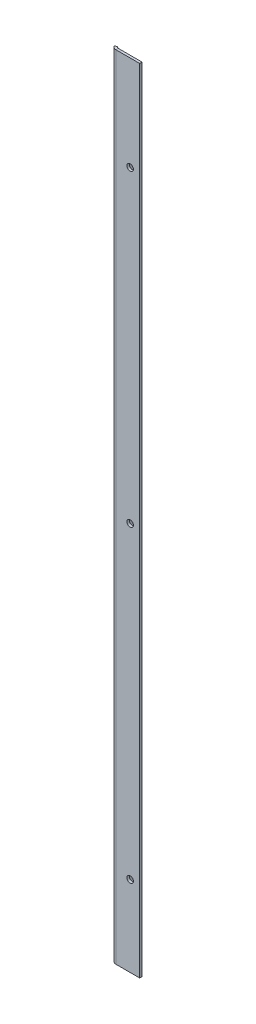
ISO-10303-21;
HEADER;
FILE_DESCRIPTION(('STEP AP214'),'2;1');
FILE_NAME('part.step','',(''),(''),'','','');
FILE_SCHEMA(('AUTOMOTIVE_DESIGN { 1 0 10303 214 1 1 1 1 }'));
ENDSEC;
DATA;
#1=APPLICATION_CONTEXT('core data for automotive mechanical design processes');
#2=APPLICATION_PROTOCOL_DEFINITION('international standard','automotive_design',2000,#1);
#3=PRODUCT_CONTEXT('',#1,'mechanical');
#4=PRODUCT('Part','Part','',(#3));
#5=PRODUCT_RELATED_PRODUCT_CATEGORY('part','',(#4));
#6=PRODUCT_DEFINITION_FORMATION('','',#4);
#7=PRODUCT_DEFINITION_CONTEXT('part definition',#1,'design');
#8=PRODUCT_DEFINITION('design','',#6,#7);
#9=PRODUCT_DEFINITION_SHAPE('','',#8);
#10=(LENGTH_UNIT() NAMED_UNIT(*) SI_UNIT(.MILLI.,.METRE.));
#11=(NAMED_UNIT(*) PLANE_ANGLE_UNIT() SI_UNIT($,.RADIAN.));
#12=(NAMED_UNIT(*) SI_UNIT($,.STERADIAN.) SOLID_ANGLE_UNIT());
#13=UNCERTAINTY_MEASURE_WITH_UNIT(LENGTH_MEASURE(1.E-05),#10,'distance_accuracy_value','');
#14=(GEOMETRIC_REPRESENTATION_CONTEXT(3) GLOBAL_UNCERTAINTY_ASSIGNED_CONTEXT((#13)) GLOBAL_UNIT_ASSIGNED_CONTEXT((#10,
#11,#12)) REPRESENTATION_CONTEXT('',''));
#15=CARTESIAN_POINT('',(0.,0.,0.));
#16=DIRECTION('',(0.,0.,1.));
#17=DIRECTION('',(1.,0.,0.));
#18=AXIS2_PLACEMENT_3D('',#15,#16,#17);
#19=CARTESIAN_POINT('',(0.,835.,25.));
#20=DIRECTION('',(0.,1.,0.));
#21=DIRECTION('',(0.,0.,1.));
#22=AXIS2_PLACEMENT_3D('',#19,#20,#21);
#23=PLANE('',#22);
#24=CARTESIAN_POINT('',(5.,835.,25.));
#25=DIRECTION('',(0.,1.,0.));
#26=DIRECTION('',(1.,0.,0.));
#27=AXIS2_PLACEMENT_3D('',#24,#25,#26);
#28=CIRCLE('',#27,2.5);
#29=CARTESIAN_POINT('',(2.8349364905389,835.,26.25));
#30=VERTEX_POINT('',#29);
#31=CARTESIAN_POINT('',(5.,835.,27.5));
#32=VERTEX_POINT('',#31);
#33=EDGE_CURVE('E128',#30,#32,#28,.T.);
#34=ORIENTED_EDGE('',*,*,#33,.F.);
#35=DIRECTION('',(-0.866025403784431,0.,0.500000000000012));
#36=VECTOR('',#35,1.);
#37=CARTESIAN_POINT('',(0.66987298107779,835.,27.5000000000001));
#38=LINE('',#37,#36);
#39=CARTESIAN_POINT('',(0.66987298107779,835.,27.5000000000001));
#40=VERTEX_POINT('',#39);
#41=EDGE_CURVE('E118',#40,#30,#38,.F.);
#42=ORIENTED_EDGE('',*,*,#41,.F.);
#43=CARTESIAN_POINT('',(5.,835.,25.));
#44=DIRECTION('',(0.,-1.,0.));
#45=DIRECTION('',(0.,0.,-1.));
#46=AXIS2_PLACEMENT_3D('',#43,#44,#45);
#47=CIRCLE('',#46,5.);
#48=CARTESIAN_POINT('',(5.,835.,30.));
#49=VERTEX_POINT('',#48);
#50=EDGE_CURVE('E67',#40,#49,#47,.F.);
#51=ORIENTED_EDGE('',*,*,#50,.T.);
#52=DIRECTION('',(0.,0.,1.));
#53=VECTOR('',#52,1.);
#54=CARTESIAN_POINT('',(5.,835.,27.5));
#55=LINE('',#54,#53);
#56=EDGE_CURVE('E11',#32,#49,#55,.T.);
#57=ORIENTED_EDGE('',*,*,#56,.F.);
#58=EDGE_LOOP('',(#34,#42,#51,#57));
#59=FACE_BOUND('',#58,.T.);
#60=ADVANCED_FACE('F42',(#59),#23,.T.);
#61=CARTESIAN_POINT('',(5.,835.,25.));
#62=DIRECTION('',(0.,-1.,0.));
#63=DIRECTION('',(0.,0.,-1.));
#64=AXIS2_PLACEMENT_3D('',#61,#62,#63);
#65=CYLINDRICAL_SURFACE('',#64,2.5);
#66=DIRECTION('',(0.,-1.,0.));
#67=VECTOR('',#66,1.);
#68=CARTESIAN_POINT('',(2.50000000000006,835.,25.));
#69=LINE('',#68,#67);
#70=CARTESIAN_POINT('',(2.50000000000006,832.5,25.));
#71=VERTEX_POINT('',#70);
#72=CARTESIAN_POINT('',(2.50000000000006,0.,25.));
#73=VERTEX_POINT('',#72);
#74=EDGE_CURVE('E157',#71,#73,#69,.T.);
#75=ORIENTED_EDGE('',*,*,#74,.F.);
#76=CARTESIAN_POINT('',(5.,832.5,25.));
#77=DIRECTION('',(0.,-0.447213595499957,0.894427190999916));
#78=DIRECTION('',(0.,-0.894427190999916,-0.447213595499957));
#79=AXIS2_PLACEMENT_3D('',#76,#77,#78);
#80=ELLIPSE('',#79,5.59016994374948,2.5);
#81=EDGE_CURVE('E124',#30,#71,#80,.T.);
#82=ORIENTED_EDGE('',*,*,#81,.F.);
#83=ORIENTED_EDGE('',*,*,#33,.T.);
#84=DIRECTION('',(0.,-1.,0.));
#85=VECTOR('',#84,1.);
#86=CARTESIAN_POINT('',(5.,835.,27.5));
#87=LINE('',#86,#85);
#88=CARTESIAN_POINT('',(5.,0.,27.5));
#89=VERTEX_POINT('',#88);
#90=EDGE_CURVE('E160',#32,#89,#87,.T.);
#91=ORIENTED_EDGE('',*,*,#90,.T.);
#92=CARTESIAN_POINT('',(5.,0.,25.));
#93=DIRECTION('',(0.,1.,0.));
#94=DIRECTION('',(1.,0.,0.));
#95=AXIS2_PLACEMENT_3D('',#92,#93,#94);
#96=CIRCLE('',#95,2.5);
#97=EDGE_CURVE('E223',#73,#89,#96,.T.);
#98=ORIENTED_EDGE('',*,*,#97,.F.);
#99=EDGE_LOOP('',(#75,#82,#83,#91,#98));
#100=FACE_BOUND('',#99,.T.);
#101=ADVANCED_FACE('F270',(#100),#65,.F.);
#102=CARTESIAN_POINT('',(2.49999999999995,835.,0.));
#103=DIRECTION('',(1.,0.,0.));
#104=DIRECTION('',(0.,0.,-1.));
#105=AXIS2_PLACEMENT_3D('',#102,#103,#104);
#106=PLANE('',#105);
#107=DIRECTION('',(0.,-1.,0.));
#108=VECTOR('',#107,1.);
#109=CARTESIAN_POINT('',(2.49999999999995,835.,0.));
#110=LINE('',#109,#108);
#111=CARTESIAN_POINT('',(2.49999999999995,807.5,0.));
#112=VERTEX_POINT('',#111);
#113=CARTESIAN_POINT('',(2.49999999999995,0.,0.));
#114=VERTEX_POINT('',#113);
#115=EDGE_CURVE('E154',#112,#114,#110,.T.);
#116=ORIENTED_EDGE('',*,*,#115,.F.);
#117=DIRECTION('',(0.,-0.70710678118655,-0.707106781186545));
#118=VECTOR('',#117,1.);
#119=CARTESIAN_POINT('',(2.49999999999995,807.5,0.));
#120=LINE('',#119,#118);
#121=EDGE_CURVE('E203',#71,#112,#120,.T.);
#122=ORIENTED_EDGE('',*,*,#121,.F.);
#123=ORIENTED_EDGE('',*,*,#74,.T.);
#124=DIRECTION('',(0.,0.,1.));
#125=VECTOR('',#124,1.);
#126=CARTESIAN_POINT('',(2.49999999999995,0.,0.));
#127=LINE('',#126,#125);
#128=EDGE_CURVE('E227',#114,#73,#127,.T.);
#129=ORIENTED_EDGE('',*,*,#128,.F.);
#130=EDGE_LOOP('',(#116,#122,#123,#129));
#131=FACE_BOUND('',#130,.T.);
#132=ADVANCED_FACE('F278',(#131),#106,.T.);
#133=CARTESIAN_POINT('',(0.,835.,0.));
#134=DIRECTION('',(0.,0.,-1.));
#135=DIRECTION('',(-1.,0.,0.));
#136=AXIS2_PLACEMENT_3D('',#133,#134,#135);
#137=PLANE('',#136);
#138=DIRECTION('',(0.,-1.,0.));
#139=VECTOR('',#138,1.);
#140=CARTESIAN_POINT('',(0.,835.,0.));
#141=LINE('',#140,#139);
#142=CARTESIAN_POINT('',(0.,807.5,0.));
#143=VERTEX_POINT('',#142);
#144=CARTESIAN_POINT('',(0.,0.,0.));
#145=VERTEX_POINT('',#144);
#146=EDGE_CURVE('E151',#143,#145,#141,.T.);
#147=ORIENTED_EDGE('',*,*,#146,.F.);
#148=DIRECTION('',(-1.,0.,0.));
#149=VECTOR('',#148,1.);
#150=CARTESIAN_POINT('',(0.,807.5,0.));
#151=LINE('',#150,#149);
#152=EDGE_CURVE('E206',#143,#112,#151,.F.);
#153=ORIENTED_EDGE('',*,*,#152,.T.);
#154=ORIENTED_EDGE('',*,*,#115,.T.);
#155=DIRECTION('',(1.,0.,0.));
#156=VECTOR('',#155,1.);
#157=CARTESIAN_POINT('',(0.,0.,0.));
#158=LINE('',#157,#156);
#159=EDGE_CURVE('E230',#145,#114,#158,.T.);
#160=ORIENTED_EDGE('',*,*,#159,.F.);
#161=EDGE_LOOP('',(#147,#153,#154,#160));
#162=FACE_BOUND('',#161,.T.);
#163=ADVANCED_FACE('F283',(#162),#137,.T.);
#164=CARTESIAN_POINT('',(0.,835.,0.));
#165=DIRECTION('',(1.,0.,0.));
#166=DIRECTION('',(0.,0.,-1.));
#167=AXIS2_PLACEMENT_3D('',#164,#165,#166);
#168=PLANE('',#167);
#169=DIRECTION('',(0.,-0.70710678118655,-0.707106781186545));
#170=VECTOR('',#169,1.);
#171=CARTESIAN_POINT('',(0.,807.5,0.));
#172=LINE('',#171,#170);
#173=CARTESIAN_POINT('',(0.,832.5,25.));
#174=VERTEX_POINT('',#173);
#175=EDGE_CURVE('E59',#174,#143,#172,.T.);
#176=ORIENTED_EDGE('',*,*,#175,.T.);
#177=ORIENTED_EDGE('',*,*,#146,.T.);
#178=DIRECTION('',(0.,0.,1.));
#179=VECTOR('',#178,1.);
#180=CARTESIAN_POINT('',(0.,0.,0.));
#181=LINE('',#180,#179);
#182=CARTESIAN_POINT('',(0.,0.,25.));
#183=VERTEX_POINT('',#182);
#184=EDGE_CURVE('E234',#145,#183,#181,.T.);
#185=ORIENTED_EDGE('',*,*,#184,.T.);
#186=DIRECTION('',(0.,-1.,0.));
#187=VECTOR('',#186,1.);
#188=CARTESIAN_POINT('',(0.,835.,25.));
#189=LINE('',#188,#187);
#190=EDGE_CURVE('E142',#174,#183,#189,.T.);
#191=ORIENTED_EDGE('',*,*,#190,.F.);
#192=EDGE_LOOP('',(#176,#177,#185,#191));
#193=FACE_BOUND('',#192,.T.);
#194=ADVANCED_FACE('F285',(#193),#168,.F.);
#195=CARTESIAN_POINT('',(5.,835.,25.));
#196=DIRECTION('',(0.,-1.,0.));
#197=DIRECTION('',(0.,0.,-1.));
#198=AXIS2_PLACEMENT_3D('',#195,#196,#197);
#199=CYLINDRICAL_SURFACE('',#198,5.);
#200=CARTESIAN_POINT('',(5.,832.5,25.));
#201=DIRECTION('',(0.,-0.707106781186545,0.70710678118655));
#202=DIRECTION('',(0.,-0.70710678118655,-0.707106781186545));
#203=AXIS2_PLACEMENT_3D('',#200,#201,#202);
#204=ELLIPSE('',#203,7.0710678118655,5.);
#205=EDGE_CURVE('E116',#40,#174,#204,.T.);
#206=ORIENTED_EDGE('',*,*,#205,.T.);
#207=ORIENTED_EDGE('',*,*,#190,.T.);
#208=CARTESIAN_POINT('',(5.,0.,25.));
#209=DIRECTION('',(0.,-1.,0.));
#210=DIRECTION('',(0.,0.,-1.));
#211=AXIS2_PLACEMENT_3D('',#208,#209,#210);
#212=CIRCLE('',#211,5.);
#213=CARTESIAN_POINT('',(5.,0.,30.));
#214=VERTEX_POINT('',#213);
#215=EDGE_CURVE('E238',#183,#214,#212,.F.);
#216=ORIENTED_EDGE('',*,*,#215,.T.);
#217=DIRECTION('',(0.,-1.,0.));
#218=VECTOR('',#217,1.);
#219=CARTESIAN_POINT('',(5.,835.,30.));
#220=LINE('',#219,#218);
#221=EDGE_CURVE('E135',#49,#214,#220,.T.);
#222=ORIENTED_EDGE('',*,*,#221,.F.);
#223=ORIENTED_EDGE('',*,*,#50,.F.);
#224=EDGE_LOOP('',(#206,#207,#216,#222,#223));
#225=FACE_BOUND('',#224,.T.);
#226=ADVANCED_FACE('F132',(#225),#199,.T.);
#227=CARTESIAN_POINT('',(5.,0.,30.));
#228=DIRECTION('',(0.,-1.,0.));
#229=DIRECTION('',(0.,0.,-1.));
#230=AXIS2_PLACEMENT_3D('',#227,#228,#229);
#231=PLANE('',#230);
#232=DIRECTION('',(0.,0.,-1.));
#233=VECTOR('',#232,1.);
#234=CARTESIAN_POINT('',(5.,0.,30.));
#235=LINE('',#234,#233);
#236=EDGE_CURVE('E51',#214,#89,#235,.T.);
#237=ORIENTED_EDGE('',*,*,#236,.F.);
#238=ORIENTED_EDGE('',*,*,#215,.F.);
#239=DIRECTION('',(-1.,0.,0.));
#240=VECTOR('',#239,1.);
#241=CARTESIAN_POINT('',(2.50000000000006,0.,25.));
#242=LINE('',#241,#240);
#243=EDGE_CURVE('E170',#73,#183,#242,.T.);
#244=ORIENTED_EDGE('',*,*,#243,.F.);
#245=ORIENTED_EDGE('',*,*,#97,.T.);
#246=EDGE_LOOP('',(#237,#238,#244,#245));
#247=FACE_BOUND('',#246,.T.);
#248=ADVANCED_FACE('F266',(#247),#231,.T.);
#249=CARTESIAN_POINT('',(2.50000000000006,0.,25.));
#250=DIRECTION('',(0.,-1.,0.));
#251=DIRECTION('',(0.,0.,-1.));
#252=AXIS2_PLACEMENT_3D('',#249,#250,#251);
#253=PLANE('',#252);
#254=DIRECTION('',(1.,0.,0.));
#255=VECTOR('',#254,1.);
#256=CARTESIAN_POINT('',(0.,0.,30.));
#257=LINE('',#256,#255);
#258=CARTESIAN_POINT('',(30.,0.,30.));
#259=VERTEX_POINT('',#258);
#260=EDGE_CURVE('E210',#214,#259,#257,.T.);
#261=ORIENTED_EDGE('',*,*,#260,.F.);
#262=ORIENTED_EDGE('',*,*,#236,.T.);
#263=DIRECTION('',(1.,0.,0.));
#264=VECTOR('',#263,1.);
#265=CARTESIAN_POINT('',(0.,0.,27.5));
#266=LINE('',#265,#264);
#267=CARTESIAN_POINT('',(30.,0.,27.5));
#268=VERTEX_POINT('',#267);
#269=EDGE_CURVE('E219',#89,#268,#266,.T.);
#270=ORIENTED_EDGE('',*,*,#269,.T.);
#271=DIRECTION('',(0.,0.,1.));
#272=VECTOR('',#271,1.);
#273=CARTESIAN_POINT('',(30.,0.,27.5));
#274=LINE('',#273,#272);
#275=EDGE_CURVE('E215',#268,#259,#274,.T.);
#276=ORIENTED_EDGE('',*,*,#275,.T.);
#277=EDGE_LOOP('',(#261,#262,#270,#276));
#278=FACE_BOUND('',#277,.T.);
#279=ADVANCED_FACE('F262',(#278),#253,.T.);
#280=CARTESIAN_POINT('',(0.,835.,30.));
#281=DIRECTION('',(0.,0.,-1.));
#282=DIRECTION('',(-1.,0.,0.));
#283=AXIS2_PLACEMENT_3D('',#280,#281,#282);
#284=PLANE('',#283);
#285=CARTESIAN_POINT('',(20.,85.,30.));
#286=DIRECTION('',(0.,0.,1.));
#287=DIRECTION('',(1.,0.,0.));
#288=AXIS2_PLACEMENT_3D('',#285,#286,#287);
#289=CIRCLE('',#288,3.40000000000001);
#290=CARTESIAN_POINT('',(23.4,85.,30.));
#291=VERTEX_POINT('',#290);
#292=EDGE_CURVE('E196',#291,#291,#289,.T.);
#293=ORIENTED_EDGE('',*,*,#292,.F.);
#294=EDGE_LOOP('',(#293));
#295=FACE_BOUND('',#294,.T.);
#296=CARTESIAN_POINT('',(20.,410.,30.));
#297=DIRECTION('',(0.,0.,1.));
#298=DIRECTION('',(1.,0.,0.));
#299=AXIS2_PLACEMENT_3D('',#296,#297,#298);
#300=CIRCLE('',#299,3.39999999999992);
#301=CARTESIAN_POINT('',(23.3999999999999,410.,30.));
#302=VERTEX_POINT('',#301);
#303=EDGE_CURVE('E181',#302,#302,#300,.T.);
#304=ORIENTED_EDGE('',*,*,#303,.F.);
#305=EDGE_LOOP('',(#304));
#306=FACE_BOUND('',#305,.T.);
#307=CARTESIAN_POINT('',(20.,735.,30.));
#308=DIRECTION('',(0.,0.,1.));
#309=DIRECTION('',(1.,0.,0.));
#310=AXIS2_PLACEMENT_3D('',#307,#308,#309);
#311=CIRCLE('',#310,3.39999999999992);
#312=CARTESIAN_POINT('',(23.3999999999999,735.,30.));
#313=VERTEX_POINT('',#312);
#314=EDGE_CURVE('E178',#313,#313,#311,.T.);
#315=ORIENTED_EDGE('',*,*,#314,.F.);
#316=EDGE_LOOP('',(#315));
#317=FACE_BOUND('',#316,.T.);
#318=ORIENTED_EDGE('',*,*,#260,.T.);
#319=DIRECTION('',(0.,-1.,0.));
#320=VECTOR('',#319,1.);
#321=CARTESIAN_POINT('',(30.,835.,30.));
#322=LINE('',#321,#320);
#323=CARTESIAN_POINT('',(30.,835.,30.));
#324=VERTEX_POINT('',#323);
#325=EDGE_CURVE('E167',#324,#259,#322,.T.);
#326=ORIENTED_EDGE('',*,*,#325,.F.);
#327=DIRECTION('',(1.,0.,0.));
#328=VECTOR('',#327,1.);
#329=CARTESIAN_POINT('',(0.,835.,30.));
#330=LINE('',#329,#328);
#331=EDGE_CURVE('E240',#49,#324,#330,.T.);
#332=ORIENTED_EDGE('',*,*,#331,.F.);
#333=ORIENTED_EDGE('',*,*,#221,.T.);
#334=EDGE_LOOP('',(#318,#326,#332,#333));
#335=FACE_BOUND('',#334,.T.);
#336=ADVANCED_FACE('F287',(#295,#306,#317,#335),#284,.F.);
#337=CARTESIAN_POINT('',(30.,835.,27.5));
#338=DIRECTION('',(1.,0.,0.));
#339=DIRECTION('',(0.,0.,-1.));
#340=AXIS2_PLACEMENT_3D('',#337,#338,#339);
#341=PLANE('',#340);
#342=ORIENTED_EDGE('',*,*,#275,.F.);
#343=DIRECTION('',(0.,-1.,0.));
#344=VECTOR('',#343,1.);
#345=CARTESIAN_POINT('',(30.,835.,27.5));
#346=LINE('',#345,#344);
#347=CARTESIAN_POINT('',(30.,835.,27.5));
#348=VERTEX_POINT('',#347);
#349=EDGE_CURVE('E164',#348,#268,#346,.T.);
#350=ORIENTED_EDGE('',*,*,#349,.F.);
#351=DIRECTION('',(0.,0.,1.));
#352=VECTOR('',#351,1.);
#353=CARTESIAN_POINT('',(30.,835.,27.5));
#354=LINE('',#353,#352);
#355=EDGE_CURVE('E243',#348,#324,#354,.T.);
#356=ORIENTED_EDGE('',*,*,#355,.T.);
#357=ORIENTED_EDGE('',*,*,#325,.T.);
#358=EDGE_LOOP('',(#342,#350,#356,#357));
#359=FACE_BOUND('',#358,.T.);
#360=ADVANCED_FACE('F259',(#359),#341,.T.);
#361=CARTESIAN_POINT('',(0.,835.,27.5));
#362=DIRECTION('',(0.,0.,-1.));
#363=DIRECTION('',(-1.,0.,0.));
#364=AXIS2_PLACEMENT_3D('',#361,#362,#363);
#365=PLANE('',#364);
#366=CARTESIAN_POINT('',(20.,85.,27.5));
#367=DIRECTION('',(0.,0.,-1.));
#368=DIRECTION('',(-1.,0.,0.));
#369=AXIS2_PLACEMENT_3D('',#366,#367,#368);
#370=CIRCLE('',#369,3.40000000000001);
#371=CARTESIAN_POINT('',(16.6,85.,27.5));
#372=VERTEX_POINT('',#371);
#373=EDGE_CURVE('E45',#372,#372,#370,.T.);
#374=ORIENTED_EDGE('',*,*,#373,.F.);
#375=EDGE_LOOP('',(#374));
#376=FACE_BOUND('',#375,.T.);
#377=CARTESIAN_POINT('',(20.,410.,27.5));
#378=DIRECTION('',(0.,0.,-1.));
#379=DIRECTION('',(-1.,0.,0.));
#380=AXIS2_PLACEMENT_3D('',#377,#378,#379);
#381=CIRCLE('',#380,3.39999999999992);
#382=CARTESIAN_POINT('',(16.6000000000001,410.,27.5));
#383=VERTEX_POINT('',#382);
#384=EDGE_CURVE('E179',#383,#383,#381,.T.);
#385=ORIENTED_EDGE('',*,*,#384,.F.);
#386=EDGE_LOOP('',(#385));
#387=FACE_BOUND('',#386,.T.);
#388=CARTESIAN_POINT('',(20.,735.,27.5));
#389=DIRECTION('',(0.,0.,-1.));
#390=DIRECTION('',(-1.,0.,0.));
#391=AXIS2_PLACEMENT_3D('',#388,#389,#390);
#392=CIRCLE('',#391,3.39999999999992);
#393=CARTESIAN_POINT('',(16.6000000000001,735.,27.5));
#394=VERTEX_POINT('',#393);
#395=EDGE_CURVE('E125',#394,#394,#392,.T.);
#396=ORIENTED_EDGE('',*,*,#395,.F.);
#397=EDGE_LOOP('',(#396));
#398=FACE_BOUND('',#397,.T.);
#399=ORIENTED_EDGE('',*,*,#269,.F.);
#400=ORIENTED_EDGE('',*,*,#90,.F.);
#401=DIRECTION('',(1.,0.,0.));
#402=VECTOR('',#401,1.);
#403=CARTESIAN_POINT('',(0.,835.,27.5));
#404=LINE('',#403,#402);
#405=EDGE_CURVE('E145',#32,#348,#404,.T.);
#406=ORIENTED_EDGE('',*,*,#405,.T.);
#407=ORIENTED_EDGE('',*,*,#349,.T.);
#408=EDGE_LOOP('',(#399,#400,#406,#407));
#409=FACE_BOUND('',#408,.T.);
#410=ADVANCED_FACE('F252',(#376,#387,#398,#409),#365,.T.);
#411=CARTESIAN_POINT('',(5.,835.,25.));
#412=DIRECTION('',(0.,1.,0.));
#413=DIRECTION('',(0.,0.,1.));
#414=AXIS2_PLACEMENT_3D('',#411,#412,#413);
#415=PLANE('',#414);
#416=ORIENTED_EDGE('',*,*,#331,.T.);
#417=ORIENTED_EDGE('',*,*,#355,.F.);
#418=ORIENTED_EDGE('',*,*,#405,.F.);
#419=ORIENTED_EDGE('',*,*,#56,.T.);
#420=EDGE_LOOP('',(#416,#417,#418,#419));
#421=FACE_BOUND('',#420,.T.);
#422=ADVANCED_FACE('F256',(#421),#415,.T.);
#423=CARTESIAN_POINT('',(5.,0.,25.));
#424=DIRECTION('',(0.,1.,0.));
#425=DIRECTION('',(0.,0.,1.));
#426=AXIS2_PLACEMENT_3D('',#423,#424,#425);
#427=PLANE('',#426);
#428=ORIENTED_EDGE('',*,*,#128,.T.);
#429=ORIENTED_EDGE('',*,*,#243,.T.);
#430=ORIENTED_EDGE('',*,*,#184,.F.);
#431=ORIENTED_EDGE('',*,*,#159,.T.);
#432=EDGE_LOOP('',(#428,#429,#430,#431));
#433=FACE_BOUND('',#432,.T.);
#434=ADVANCED_FACE('F273',(#433),#427,.F.);
#435=CARTESIAN_POINT('',(0.,807.5,0.));
#436=DIRECTION('',(0.,-0.707106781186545,0.70710678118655));
#437=DIRECTION('',(0.,-0.70710678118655,-0.707106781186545));
#438=AXIS2_PLACEMENT_3D('',#435,#436,#437);
#439=PLANE('',#438);
#440=ORIENTED_EDGE('',*,*,#152,.F.);
#441=ORIENTED_EDGE('',*,*,#175,.F.);
#442=DIRECTION('',(-1.,0.,0.));
#443=VECTOR('',#442,1.);
#444=CARTESIAN_POINT('',(0.,832.5,25.));
#445=LINE('',#444,#443);
#446=EDGE_CURVE('E120',#174,#71,#445,.F.);
#447=ORIENTED_EDGE('',*,*,#446,.T.);
#448=ORIENTED_EDGE('',*,*,#121,.T.);
#449=EDGE_LOOP('',(#440,#441,#447,#448));
#450=FACE_BOUND('',#449,.T.);
#451=ADVANCED_FACE('F280',(#450),#439,.F.);
#452=CARTESIAN_POINT('',(5.,827.5,22.5));
#453=CARTESIAN_POINT('',(5.,827.5,21.6666666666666));
#454=CARTESIAN_POINT('',(5.,827.5,20.8333333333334));
#455=CARTESIAN_POINT('',(5.,827.5,20.));
#456=CARTESIAN_POINT('',(9.99999999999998,827.5,22.5));
#457=CARTESIAN_POINT('',(11.6666666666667,827.5,21.6666666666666));
#458=CARTESIAN_POINT('',(13.3333333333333,827.5,20.8333333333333));
#459=CARTESIAN_POINT('',(15.,827.5,20.));
#460=CARTESIAN_POINT('',(9.99999999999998,837.5,27.5));
#461=CARTESIAN_POINT('',(11.6666666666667,837.5,28.3333333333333));
#462=CARTESIAN_POINT('',(13.3333333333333,837.5,29.1666666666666));
#463=CARTESIAN_POINT('',(15.,837.5,30.));
#464=CARTESIAN_POINT('',(5.,837.5,27.5));
#465=CARTESIAN_POINT('',(5.,837.5,28.3333333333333));
#466=CARTESIAN_POINT('',(5.,837.5,29.1666666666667));
#467=CARTESIAN_POINT('',(5.,837.5,30.));
#468=CARTESIAN_POINT('',(0.,837.5,27.5));
#469=CARTESIAN_POINT('',(-1.66666666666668,837.5,28.3333333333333));
#470=CARTESIAN_POINT('',(-3.33333333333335,837.5,29.1666666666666));
#471=CARTESIAN_POINT('',(-5.00000000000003,837.5,30.));
#472=CARTESIAN_POINT('',(0.,827.5,22.5));
#473=CARTESIAN_POINT('',(-1.66666666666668,827.5,21.6666666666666));
#474=CARTESIAN_POINT('',(-3.33333333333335,827.5,20.8333333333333));
#475=CARTESIAN_POINT('',(-5.00000000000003,827.5,20.));
#476=CARTESIAN_POINT('',(5.,827.5,22.5));
#477=CARTESIAN_POINT('',(5.,827.5,21.6666666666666));
#478=CARTESIAN_POINT('',(5.,827.5,20.8333333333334));
#479=CARTESIAN_POINT('',(5.,827.5,20.));
#480=(BOUNDED_SURFACE() B_SPLINE_SURFACE(3,3,((#452,#453,#454,#455),(#456,#457,#458,#459),(#460,
#461,#462,#463),(#464,#465,#466,#467),(#468,#469,#470,#471),(#472,#473,#474,#475),(#476,#477,
#478,#479)),.UNSPECIFIED.,.T.,.F.,.F.) B_SPLINE_SURFACE_WITH_KNOTS((4,3,4),(4,4),(0.,0.5,1.),
(0.,1.),.UNSPECIFIED.) GEOMETRIC_REPRESENTATION_ITEM() RATIONAL_B_SPLINE_SURFACE(((1.,1.,1.,1.),
(0.333333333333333,0.333333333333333,0.333333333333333,0.333333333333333),(0.333333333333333,
0.333333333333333,0.333333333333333,0.333333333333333),(1.,1.,1.,1.),(0.333333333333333,
0.333333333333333,0.333333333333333,0.333333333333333),(0.333333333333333,0.333333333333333,
0.333333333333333,0.333333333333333),(1.,1.,1.,1.))) REPRESENTATION_ITEM('') SURFACE());
#481=ORIENTED_EDGE('',*,*,#446,.F.);
#482=ORIENTED_EDGE('',*,*,#205,.F.);
#483=ORIENTED_EDGE('',*,*,#41,.T.);
#484=ORIENTED_EDGE('',*,*,#81,.T.);
#485=EDGE_LOOP('',(#481,#482,#483,#484));
#486=FACE_BOUND('',#485,.T.);
#487=ADVANCED_FACE('F117',(#486),#480,.T.);
#488=CARTESIAN_POINT('',(20.,735.,20.));
#489=DIRECTION('',(0.,0.,1.));
#490=DIRECTION('',(1.,0.,0.));
#491=AXIS2_PLACEMENT_3D('',#488,#489,#490);
#492=CYLINDRICAL_SURFACE('',#491,3.39999999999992);
#493=ORIENTED_EDGE('',*,*,#395,.T.);
#494=EDGE_LOOP('',(#493));
#495=FACE_BOUND('',#494,.T.);
#496=ORIENTED_EDGE('',*,*,#314,.T.);
#497=EDGE_LOOP('',(#496));
#498=FACE_BOUND('',#497,.T.);
#499=ADVANCED_FACE('F321',(#495,#498),#492,.F.);
#500=CARTESIAN_POINT('',(20.,410.,20.));
#501=DIRECTION('',(0.,0.,1.));
#502=DIRECTION('',(1.,0.,0.));
#503=AXIS2_PLACEMENT_3D('',#500,#501,#502);
#504=CYLINDRICAL_SURFACE('',#503,3.39999999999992);
#505=ORIENTED_EDGE('',*,*,#384,.T.);
#506=EDGE_LOOP('',(#505));
#507=FACE_BOUND('',#506,.T.);
#508=ORIENTED_EDGE('',*,*,#303,.T.);
#509=EDGE_LOOP('',(#508));
#510=FACE_BOUND('',#509,.T.);
#511=ADVANCED_FACE('F324',(#507,#510),#504,.F.);
#512=CARTESIAN_POINT('',(20.,85.,20.));
#513=DIRECTION('',(0.,0.,1.));
#514=DIRECTION('',(1.,0.,0.));
#515=AXIS2_PLACEMENT_3D('',#512,#513,#514);
#516=CYLINDRICAL_SURFACE('',#515,3.40000000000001);
#517=ORIENTED_EDGE('',*,*,#373,.T.);
#518=EDGE_LOOP('',(#517));
#519=FACE_BOUND('',#518,.T.);
#520=ORIENTED_EDGE('',*,*,#292,.T.);
#521=EDGE_LOOP('',(#520));
#522=FACE_BOUND('',#521,.T.);
#523=ADVANCED_FACE('F332',(#519,#522),#516,.F.);
#524=CLOSED_SHELL('',(#60,#101,#132,#163,#194,#226,#248,#279,#336,#360,#410,#422,#434,#451,#487,
#499,#511,#523));
#525=MANIFOLD_SOLID_BREP('B2',#524);
#526=ADVANCED_BREP_SHAPE_REPRESENTATION('',(#18,#525),#14);
#527=SHAPE_DEFINITION_REPRESENTATION(#9,#526);
ENDSEC;
END-ISO-10303-21;
